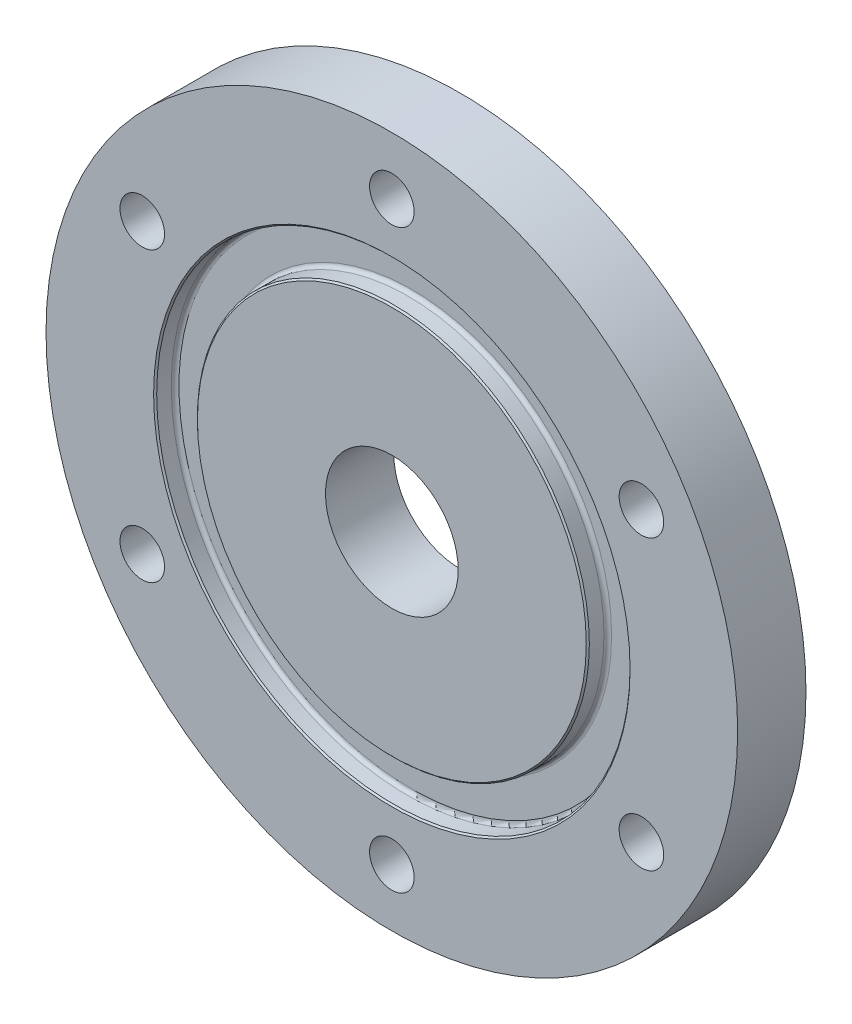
from build123d import *

# Parameters (mm, degrees)
SKETCH1_R            = 45
BOSS_EXTRUDE1_DEPTH  = 8.89
SKETCH2_R            = 30.8
SKETCH2_R_2          = 25.5
CUT_EXTRUDE1_DEPTH   = 2.6
M5_CLEARANCE_HOLE1_D = 5.8
CIRPATTERN1_COUNT    = 6
FILLET1_R            = 0.5
CHAMFER1_SIZE        = 0.2
CUT_EXTRUDE2_REACH   = 66.258
SKETCH6_R            = 8.636


with BuildPart() as part:
    # Sketch1 → Boss-Extrude1 (new body)
    with BuildSketch(Plane.XY):
        Circle(SKETCH1_R)
    extrude(amount=BOSS_EXTRUDE1_DEPTH)

    # Sketch2 → Cut-Extrude1 (cut)
    with BuildSketch(Plane.XY.offset(8.89)):
        Circle(SKETCH2_R)
        Circle(SKETCH2_R_2, mode=Mode.SUBTRACT)
    extrude(amount=-CUT_EXTRUDE1_DEPTH, mode=Mode.SUBTRACT)

    # M5 Clearance Hole1 (through all)
    with Locations(Plane.XY.offset(8.89)):
        with Locations((0, 37.5)):
            m5_clearance_hole1 = Hole(M5_CLEARANCE_HOLE1_D / 2)

    # CirPattern1: M5 Clearance Hole1 ×6 about axis
    cirpattern1_axis = Axis((0, 0, 0), (0, 0, 1))
    for i in range(1, CIRPATTERN1_COUNT):
        add(m5_clearance_hole1.rotate(cirpattern1_axis, i * 360 / CIRPATTERN1_COUNT), mode=Mode.SUBTRACT)

    # Fillet1
    fillet1_edges = [part.edges().sort_by_distance(p)[0] for p in [
        (-30.8, 0, 6.29),
        (-25.5, 0, 6.29),
    ]]
    fillet(fillet1_edges, radius=FILLET1_R)

    # Chamfer1
    chamfer1_edges = [part.edges().sort_by_distance(p)[0] for p in [
        (-25.5, 0, 8.89),
        (-30.8, 0, 8.89),
    ]]
    chamfer(chamfer1_edges, length=CHAMFER1_SIZE)

    # Sketch6 → Cut-Extrude2 (cut, up to next)
    with BuildSketch(Plane(origin=(0, 0, 0), x_dir=(-1, 0, 0), z_dir=(0, 0, -1)), mode=Mode.PRIVATE) as cut_extrude2_sk1:
        Circle(SKETCH6_R)
    cut_extrude2_tool1 = extrude(cut_extrude2_sk1.sketch, amount=-CUT_EXTRUDE2_REACH, mode=Mode.PRIVATE) & part.part
    add(cut_extrude2_tool1.solids().sort_by_distance((0, 0, 0))[0], mode=Mode.SUBTRACT)


solid = part.part
